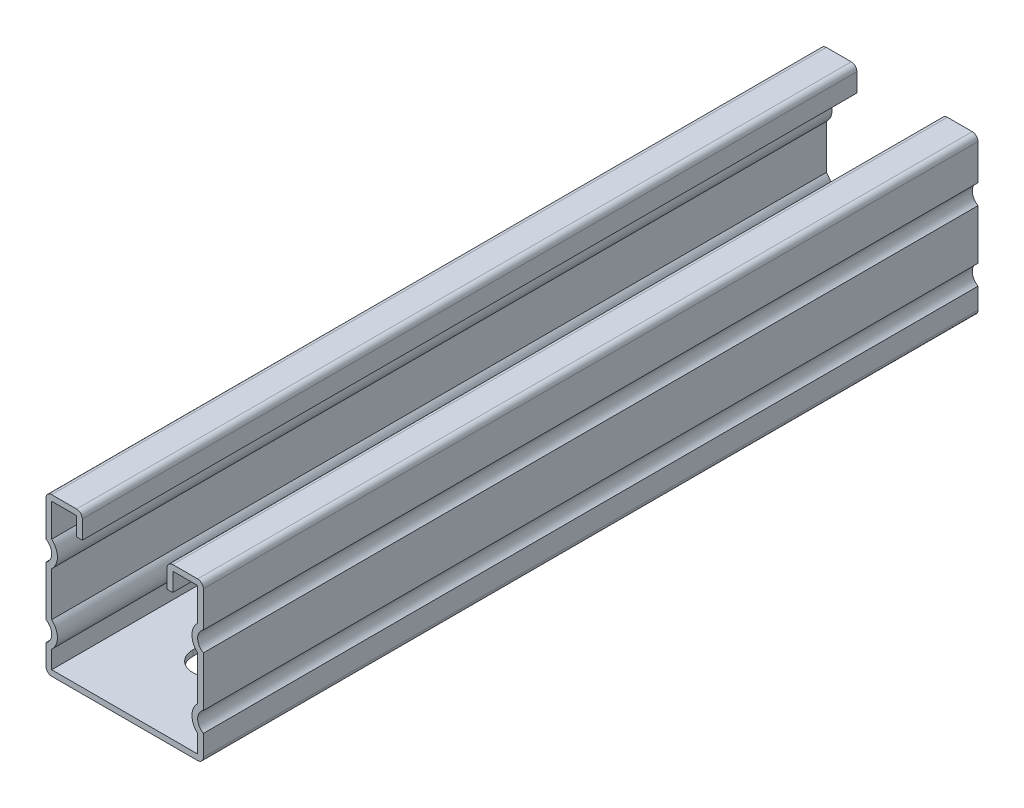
from build123d import *

# Parameters (mm, degrees)
BASE_EXTRUDE_DEPTH = 203.2
SLOT_DEPTH         = 227.830922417
LPATTERN1_COUNT    = 2
LPATTERN1_PITCH    = 101.6


with BuildPart() as part:
    # Sketch1 → Base-Extrude (new body)
    with BuildSketch(Plane.XY):
        with BuildLine():
            Line((-20.6375, 21.1074), (-20.6375, 11.73965134))
            ThreePointArc((-20.6375, 11.73965134), (-19.1389, 9.144), (-20.6375, 6.54834866))
            Line((-20.6375, 6.54834866), (-20.6375, -6.54834866))
            ThreePointArc((-20.6375, -6.54834866), (-19.1389, -9.144), (-20.6375, -11.73965134))
            Line((-20.6375, -11.73965134), (-20.6375, -17.1704))
            ThreePointArc((-20.6375, -17.1704), (-20.198570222, -18.230070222), (-19.1389, -18.669))
            Line((-19.1389, -18.669), (19.1389, -18.669))
            ThreePointArc((19.1389, -18.669), (20.198570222, -18.230070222), (20.6375, -17.1704))
            Line((20.6375, -17.1704), (20.6375, -11.73965134))
            ThreePointArc((20.6375, -11.73965134), (19.1389, -9.144), (20.6375, -6.54834866))
            Line((20.6375, -6.54834866), (20.6375, 6.54834866))
            ThreePointArc((20.6375, 6.54834866), (19.1389, 9.144), (20.6375, 11.73965134))
            Line((20.6375, 11.73965134), (20.6375, 21.1074))
            ThreePointArc((20.6375, 21.1074), (20.198570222, 22.167070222), (19.1389, 22.606))
            Line((19.1389, 22.606), (12.6111, 22.606))
            ThreePointArc((12.6111, 22.606), (11.551429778, 22.167070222), (11.1125, 21.1074))
            Line((11.1125, 21.1074), (11.1125, 16.256))
            Line((11.1125, 16.256), (12.6111, 16.256))
            Line((12.6111, 16.256), (12.6111, 21.1074))
            Line((12.6111, 21.1074), (19.1389, 21.1074))
            Line((19.1389, 21.1074), (19.1389, 12.494971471))
            ThreePointArc((19.1389, 12.494971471), (17.6403, 9.144), (19.1389, 5.793028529))
            Line((19.1389, 5.793028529), (19.1389, -5.793028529))
            ThreePointArc((19.1389, -5.793028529), (17.6403, -9.144), (19.1389, -12.494971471))
            Line((19.1389, -12.494971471), (19.1389, -17.1704))
            Line((19.1389, -17.1704), (-19.1389, -17.1704))
            Line((-19.1389, -17.1704), (-19.1389, -12.494971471))
            ThreePointArc((-19.1389, -12.494971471), (-17.6403, -9.144), (-19.1389, -5.793028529))
            Line((-19.1389, -5.793028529), (-19.1389, 5.793028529))
            ThreePointArc((-19.1389, 5.793028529), (-17.6403, 9.144), (-19.1389, 12.494971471))
            Line((-19.1389, 12.494971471), (-19.1389, 21.1074))
            Line((-19.1389, 21.1074), (-12.6111, 21.1074))
            Line((-12.6111, 21.1074), (-12.6111, 16.256))
            Line((-12.6111, 16.256), (-11.1125, 16.256))
            Line((-11.1125, 16.256), (-11.1125, 21.1074))
            ThreePointArc((-11.1125, 21.1074), (-11.551429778, 22.167070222), (-12.6111, 22.606))
            Line((-12.6111, 22.606), (-19.1389, 22.606))
            ThreePointArc((-19.1389, 22.606), (-20.198570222, 22.167070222), (-20.6375, 21.1074))
        make_face()
    extrude(amount=BASE_EXTRUDE_DEPTH)

    # Sketch2 → Slot (cut, through all)
    with BuildSketch(Plane(origin=(1.121412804, -18.669, -18.780160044), x_dir=(1, 0, 0), z_dir=(0, -1, 0))):
        with BuildLine():
            Line((4.037962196, 97.361410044), (4.037962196, 31.480160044))
            ThreePointArc((4.037962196, 31.480160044), (-1.121412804, 26.320785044), (-6.280787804, 31.480160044))
            Line((-6.280787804, 31.480160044), (-6.280787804, 97.361410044))
            ThreePointArc((-6.280787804, 97.361410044), (-1.121412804, 102.520785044), (4.037962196, 97.361410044))
        make_face()
    slot = extrude(amount=-SLOT_DEPTH, mode=Mode.SUBTRACT)

    # LPattern1: Slot ×2
    with Locations(*[(0, 0, i * LPATTERN1_PITCH) for i in range(1, LPATTERN1_COUNT)]):
        add(slot, mode=Mode.SUBTRACT)


solid = part.part
